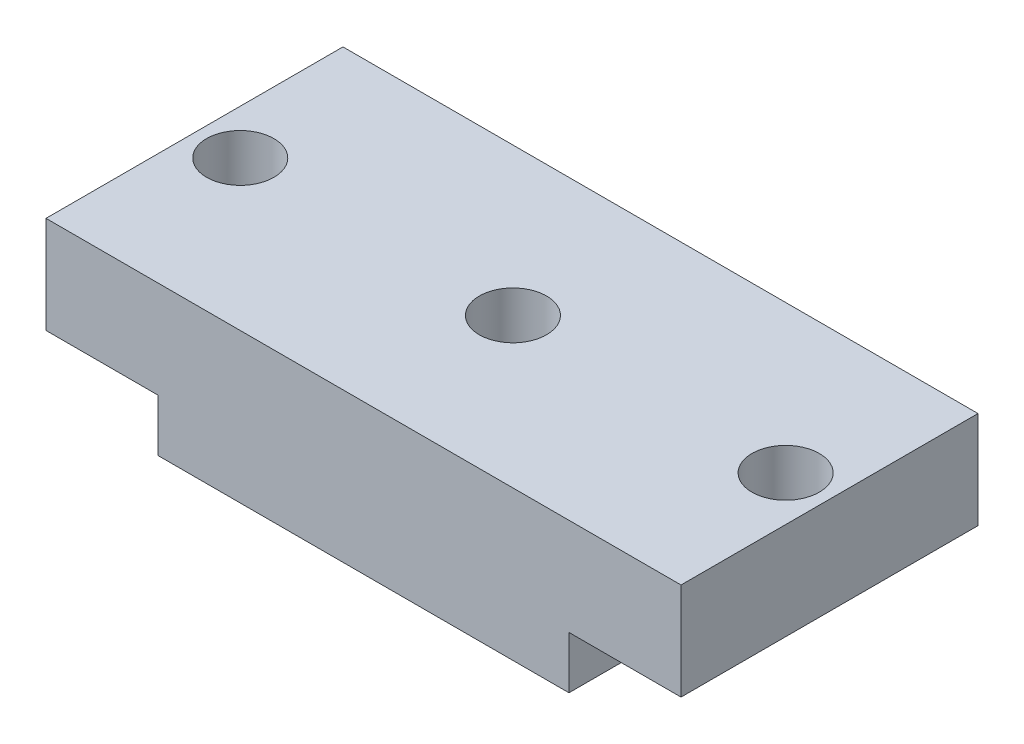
from build123d import *

# Parameters (mm, degrees)
BASE_EXTRUSION_DEPTH      = 60
BASE_EXTRUSION_DEPTH_BACK = 19.5
ESQUISSE1_W               = 170
ESQUISSE1_H               = 40
ESQUISSE2_W               = 30
ESQUISSE2_H               = 14
ENL_V_MAT_EXTRU_1_DEPTH   = 80
D_GAGEMENT_M11_D          = 18
D_GAGEMENT_M11_DEPTH      = 40
D_GAGEMENT_M11_TIP        = 5.407745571
CONG_1_R                  = 0.3


with BuildPart() as part:
    # Esquisse1 → Base-Extrusion (new, two sides: drawn at the far end of the back side and taken through both)
    with BuildSketch(Plane.XY.offset(-BASE_EXTRUSION_DEPTH_BACK)):
        with Locations((-12.483933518, 16.780747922)):
            Rectangle(ESQUISSE1_W, ESQUISSE1_H)
    extrude(amount=BASE_EXTRUSION_DEPTH + BASE_EXTRUSION_DEPTH_BACK)

    # Esquisse2 → Enl_v. mat.-Extru.1 (cut)
    with BuildSketch(Plane.XY.offset(60)):
        with Locations((57.516066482, 3.780747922)):
            Rectangle(ESQUISSE2_W, ESQUISSE2_H)
        with Locations((-82.483933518, 3.780747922)):
            Rectangle(ESQUISSE2_W, ESQUISSE2_H)
    extrude(amount=-ENL_V_MAT_EXTRU_1_DEPTH, mode=Mode.SUBTRACT)

    # D_gagement M11
    with Locations(Plane(origin=(0, 36.780747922, 0), x_dir=(-1, 0, 0), z_dir=(0, 1, 0))):
        with Locations((12.483933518, 20), (-60.516066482, 20), (85.483933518, 20)):
            Hole(D_GAGEMENT_M11_D / 2, depth=D_GAGEMENT_M11_DEPTH)
            with Locations((0, 0, -(D_GAGEMENT_M11_DEPTH + D_GAGEMENT_M11_TIP / 2))):  # 118° drill point
                Cone(0, D_GAGEMENT_M11_D / 2, D_GAGEMENT_M11_TIP, mode=Mode.SUBTRACT)

    # Cong_1
    cong_1_edges = [part.edges().sort_by_distance(p)[0] for p in [
        (-12.483933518, -3.219252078, -19.5),
    ]]
    fillet(cong_1_edges, radius=CONG_1_R)


solid = part.part
